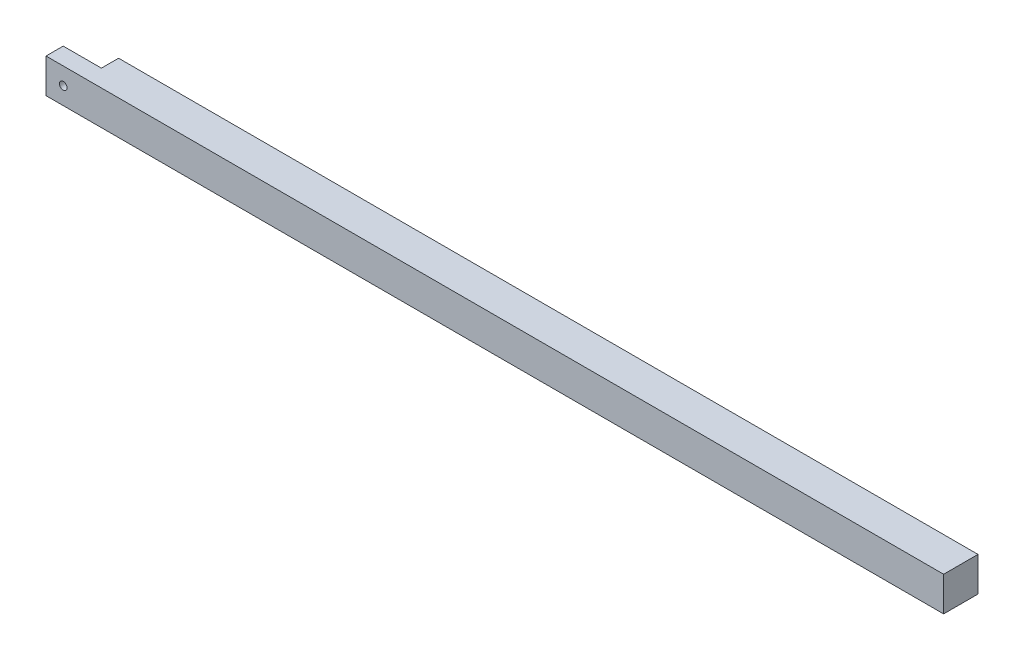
ISO-10303-21;
HEADER;
FILE_DESCRIPTION(('STEP AP214'),'2;1');
FILE_NAME('part.step','',(''),(''),'','','');
FILE_SCHEMA(('AUTOMOTIVE_DESIGN { 1 0 10303 214 1 1 1 1 }'));
ENDSEC;
DATA;
#1=APPLICATION_CONTEXT('core data for automotive mechanical design processes');
#2=APPLICATION_PROTOCOL_DEFINITION('international standard','automotive_design',2000,#1);
#3=PRODUCT_CONTEXT('',#1,'mechanical');
#4=PRODUCT('Part','Part','',(#3));
#5=PRODUCT_RELATED_PRODUCT_CATEGORY('part','',(#4));
#6=PRODUCT_DEFINITION_FORMATION('','',#4);
#7=PRODUCT_DEFINITION_CONTEXT('part definition',#1,'design');
#8=PRODUCT_DEFINITION('design','',#6,#7);
#9=PRODUCT_DEFINITION_SHAPE('','',#8);
#10=(LENGTH_UNIT() NAMED_UNIT(*) SI_UNIT(.MILLI.,.METRE.));
#11=(NAMED_UNIT(*) PLANE_ANGLE_UNIT() SI_UNIT($,.RADIAN.));
#12=(NAMED_UNIT(*) SI_UNIT($,.STERADIAN.) SOLID_ANGLE_UNIT());
#13=UNCERTAINTY_MEASURE_WITH_UNIT(LENGTH_MEASURE(1.E-05),#10,'distance_accuracy_value','');
#14=(GEOMETRIC_REPRESENTATION_CONTEXT(3) GLOBAL_UNCERTAINTY_ASSIGNED_CONTEXT((#13)) GLOBAL_UNIT_ASSIGNED_CONTEXT((#10,
#11,#12)) REPRESENTATION_CONTEXT('',''));
#15=CARTESIAN_POINT('',(0.,0.,0.));
#16=DIRECTION('',(0.,0.,1.));
#17=DIRECTION('',(1.,0.,0.));
#18=AXIS2_PLACEMENT_3D('',#15,#16,#17);
#19=CARTESIAN_POINT('',(0.,0.,9.));
#20=DIRECTION('',(1.,0.,0.));
#21=DIRECTION('',(0.,0.,-1.));
#22=AXIS2_PLACEMENT_3D('',#19,#20,#21);
#23=PLANE('',#22);
#24=DIRECTION('',(0.,1.,0.));
#25=VECTOR('',#24,1.);
#26=CARTESIAN_POINT('',(0.,0.,4.5));
#27=LINE('',#26,#25);
#28=CARTESIAN_POINT('',(0.,0.,4.5));
#29=VERTEX_POINT('',#28);
#30=CARTESIAN_POINT('',(0.,9.,4.5));
#31=VERTEX_POINT('',#30);
#32=EDGE_CURVE('E92',#29,#31,#27,.T.);
#33=ORIENTED_EDGE('',*,*,#32,.F.);
#34=DIRECTION('',(0.,0.,-1.));
#35=VECTOR('',#34,1.);
#36=CARTESIAN_POINT('',(0.,0.,9.));
#37=LINE('',#36,#35);
#38=CARTESIAN_POINT('',(0.,0.,9.));
#39=VERTEX_POINT('',#38);
#40=EDGE_CURVE('E11',#39,#29,#37,.T.);
#41=ORIENTED_EDGE('',*,*,#40,.F.);
#42=DIRECTION('',(0.,-1.,0.));
#43=VECTOR('',#42,1.);
#44=CARTESIAN_POINT('',(0.,0.,9.));
#45=LINE('',#44,#43);
#46=CARTESIAN_POINT('',(0.,9.,9.));
#47=VERTEX_POINT('',#46);
#48=EDGE_CURVE('E111',#47,#39,#45,.T.);
#49=ORIENTED_EDGE('',*,*,#48,.F.);
#50=DIRECTION('',(0.,0.,-1.));
#51=VECTOR('',#50,1.);
#52=CARTESIAN_POINT('',(0.,9.,9.));
#53=LINE('',#52,#51);
#54=EDGE_CURVE('E107',#47,#31,#53,.T.);
#55=ORIENTED_EDGE('',*,*,#54,.T.);
#56=EDGE_LOOP('',(#33,#41,#49,#55));
#57=FACE_BOUND('',#56,.T.);
#58=ADVANCED_FACE('F30',(#57),#23,.F.);
#59=CARTESIAN_POINT('',(0.,0.,9.));
#60=DIRECTION('',(0.,1.,0.));
#61=DIRECTION('',(0.,0.,1.));
#62=AXIS2_PLACEMENT_3D('',#59,#60,#61);
#63=PLANE('',#62);
#64=DIRECTION('',(-1.,0.,0.));
#65=VECTOR('',#64,1.);
#66=CARTESIAN_POINT('',(0.,0.,4.5));
#67=LINE('',#66,#65);
#68=CARTESIAN_POINT('',(10.,0.,4.5));
#69=VERTEX_POINT('',#68);
#70=EDGE_CURVE('E98',#69,#29,#67,.T.);
#71=ORIENTED_EDGE('',*,*,#70,.F.);
#72=DIRECTION('',(0.,0.,-1.));
#73=VECTOR('',#72,1.);
#74=CARTESIAN_POINT('',(10.,0.,4.5));
#75=LINE('',#74,#73);
#76=CARTESIAN_POINT('',(10.,0.,0.));
#77=VERTEX_POINT('',#76);
#78=EDGE_CURVE('E127',#69,#77,#75,.T.);
#79=ORIENTED_EDGE('',*,*,#78,.T.);
#80=DIRECTION('',(1.,0.,0.));
#81=VECTOR('',#80,1.);
#82=CARTESIAN_POINT('',(0.,0.,0.));
#83=LINE('',#82,#81);
#84=CARTESIAN_POINT('',(235.,0.,0.));
#85=VERTEX_POINT('',#84);
#86=EDGE_CURVE('E126',#77,#85,#83,.T.);
#87=ORIENTED_EDGE('',*,*,#86,.T.);
#88=DIRECTION('',(0.,0.,-1.));
#89=VECTOR('',#88,1.);
#90=CARTESIAN_POINT('',(235.,0.,9.));
#91=LINE('',#90,#89);
#92=CARTESIAN_POINT('',(235.,0.,9.));
#93=VERTEX_POINT('',#92);
#94=EDGE_CURVE('E37',#93,#85,#91,.T.);
#95=ORIENTED_EDGE('',*,*,#94,.F.);
#96=DIRECTION('',(1.,0.,0.));
#97=VECTOR('',#96,1.);
#98=CARTESIAN_POINT('',(0.,0.,9.));
#99=LINE('',#98,#97);
#100=EDGE_CURVE('E76',#39,#93,#99,.T.);
#101=ORIENTED_EDGE('',*,*,#100,.F.);
#102=ORIENTED_EDGE('',*,*,#40,.T.);
#103=EDGE_LOOP('',(#71,#79,#87,#95,#101,#102));
#104=FACE_BOUND('',#103,.T.);
#105=ADVANCED_FACE('F156',(#104),#63,.F.);
#106=CARTESIAN_POINT('',(235.,0.,9.));
#107=DIRECTION('',(-1.,0.,0.));
#108=DIRECTION('',(0.,0.,1.));
#109=AXIS2_PLACEMENT_3D('',#106,#107,#108);
#110=PLANE('',#109);
#111=DIRECTION('',(0.,1.,0.));
#112=VECTOR('',#111,1.);
#113=CARTESIAN_POINT('',(235.,0.,0.));
#114=LINE('',#113,#112);
#115=CARTESIAN_POINT('',(235.,9.,0.));
#116=VERTEX_POINT('',#115);
#117=EDGE_CURVE('E69',#85,#116,#114,.T.);
#118=ORIENTED_EDGE('',*,*,#117,.T.);
#119=DIRECTION('',(0.,0.,-1.));
#120=VECTOR('',#119,1.);
#121=CARTESIAN_POINT('',(235.,9.,9.));
#122=LINE('',#121,#120);
#123=CARTESIAN_POINT('',(235.,9.,9.));
#124=VERTEX_POINT('',#123);
#125=EDGE_CURVE('E112',#124,#116,#122,.T.);
#126=ORIENTED_EDGE('',*,*,#125,.F.);
#127=DIRECTION('',(0.,1.,0.));
#128=VECTOR('',#127,1.);
#129=CARTESIAN_POINT('',(235.,0.,9.));
#130=LINE('',#129,#128);
#131=EDGE_CURVE('E115',#93,#124,#130,.T.);
#132=ORIENTED_EDGE('',*,*,#131,.F.);
#133=ORIENTED_EDGE('',*,*,#94,.T.);
#134=EDGE_LOOP('',(#118,#126,#132,#133));
#135=FACE_BOUND('',#134,.T.);
#136=ADVANCED_FACE('F121',(#135),#110,.F.);
#137=CARTESIAN_POINT('',(0.,9.,9.));
#138=DIRECTION('',(0.,-1.,0.));
#139=DIRECTION('',(0.,0.,-1.));
#140=AXIS2_PLACEMENT_3D('',#137,#138,#139);
#141=PLANE('',#140);
#142=DIRECTION('',(-1.,0.,0.));
#143=VECTOR('',#142,1.);
#144=CARTESIAN_POINT('',(0.,9.,0.));
#145=LINE('',#144,#143);
#146=CARTESIAN_POINT('',(10.,9.,0.));
#147=VERTEX_POINT('',#146);
#148=EDGE_CURVE('E118',#116,#147,#145,.T.);
#149=ORIENTED_EDGE('',*,*,#148,.T.);
#150=DIRECTION('',(0.,0.,-1.));
#151=VECTOR('',#150,1.);
#152=CARTESIAN_POINT('',(10.,9.,4.5));
#153=LINE('',#152,#151);
#154=CARTESIAN_POINT('',(10.,9.,4.5));
#155=VERTEX_POINT('',#154);
#156=EDGE_CURVE('E44',#155,#147,#153,.T.);
#157=ORIENTED_EDGE('',*,*,#156,.F.);
#158=DIRECTION('',(1.,0.,0.));
#159=VECTOR('',#158,1.);
#160=CARTESIAN_POINT('',(0.,9.,4.5));
#161=LINE('',#160,#159);
#162=EDGE_CURVE('E96',#31,#155,#161,.T.);
#163=ORIENTED_EDGE('',*,*,#162,.F.);
#164=ORIENTED_EDGE('',*,*,#54,.F.);
#165=DIRECTION('',(-1.,0.,0.));
#166=VECTOR('',#165,1.);
#167=CARTESIAN_POINT('',(0.,9.,9.));
#168=LINE('',#167,#166);
#169=EDGE_CURVE('E53',#124,#47,#168,.T.);
#170=ORIENTED_EDGE('',*,*,#169,.F.);
#171=ORIENTED_EDGE('',*,*,#125,.T.);
#172=EDGE_LOOP('',(#149,#157,#163,#164,#170,#171));
#173=FACE_BOUND('',#172,.T.);
#174=ADVANCED_FACE('F106',(#173),#141,.F.);
#175=CARTESIAN_POINT('',(0.,9.,9.));
#176=DIRECTION('',(0.,0.,-1.));
#177=DIRECTION('',(-1.,0.,0.));
#178=AXIS2_PLACEMENT_3D('',#175,#176,#177);
#179=PLANE('',#178);
#180=CARTESIAN_POINT('',(4.5,4.5,9.));
#181=DIRECTION('',(0.,0.,1.));
#182=DIRECTION('',(1.,0.,0.));
#183=AXIS2_PLACEMENT_3D('',#180,#181,#182);
#184=CIRCLE('',#183,1.);
#185=CARTESIAN_POINT('',(5.5,4.5,9.));
#186=VERTEX_POINT('',#185);
#187=EDGE_CURVE('E140',#186,#186,#184,.T.);
#188=ORIENTED_EDGE('',*,*,#187,.F.);
#189=EDGE_LOOP('',(#188));
#190=FACE_BOUND('',#189,.T.);
#191=ORIENTED_EDGE('',*,*,#48,.T.);
#192=ORIENTED_EDGE('',*,*,#100,.T.);
#193=ORIENTED_EDGE('',*,*,#131,.T.);
#194=ORIENTED_EDGE('',*,*,#169,.T.);
#195=EDGE_LOOP('',(#191,#192,#193,#194));
#196=FACE_BOUND('',#195,.T.);
#197=ADVANCED_FACE('F153',(#190,#196),#179,.F.);
#198=CARTESIAN_POINT('',(0.,9.,0.));
#199=DIRECTION('',(0.,0.,-1.));
#200=DIRECTION('',(-1.,0.,0.));
#201=AXIS2_PLACEMENT_3D('',#198,#199,#200);
#202=PLANE('',#201);
#203=DIRECTION('',(0.,-1.,0.));
#204=VECTOR('',#203,1.);
#205=CARTESIAN_POINT('',(10.,0.,0.));
#206=LINE('',#205,#204);
#207=EDGE_CURVE('E102',#147,#77,#206,.T.);
#208=ORIENTED_EDGE('',*,*,#207,.F.);
#209=ORIENTED_EDGE('',*,*,#148,.F.);
#210=ORIENTED_EDGE('',*,*,#117,.F.);
#211=ORIENTED_EDGE('',*,*,#86,.F.);
#212=EDGE_LOOP('',(#208,#209,#210,#211));
#213=FACE_BOUND('',#212,.T.);
#214=ADVANCED_FACE('F125',(#213),#202,.T.);
#215=CARTESIAN_POINT('',(10.,0.,4.5));
#216=DIRECTION('',(1.,0.,0.));
#217=DIRECTION('',(0.,0.,-1.));
#218=AXIS2_PLACEMENT_3D('',#215,#216,#217);
#219=PLANE('',#218);
#220=ORIENTED_EDGE('',*,*,#207,.T.);
#221=ORIENTED_EDGE('',*,*,#78,.F.);
#222=DIRECTION('',(0.,-1.,0.));
#223=VECTOR('',#222,1.);
#224=CARTESIAN_POINT('',(10.,0.,4.5));
#225=LINE('',#224,#223);
#226=EDGE_CURVE('E109',#155,#69,#225,.T.);
#227=ORIENTED_EDGE('',*,*,#226,.F.);
#228=ORIENTED_EDGE('',*,*,#156,.T.);
#229=EDGE_LOOP('',(#220,#221,#227,#228));
#230=FACE_BOUND('',#229,.T.);
#231=ADVANCED_FACE('F157',(#230),#219,.F.);
#232=CARTESIAN_POINT('',(0.,9.,4.5));
#233=DIRECTION('',(0.,0.,-1.));
#234=DIRECTION('',(-1.,0.,0.));
#235=AXIS2_PLACEMENT_3D('',#232,#233,#234);
#236=PLANE('',#235);
#237=CARTESIAN_POINT('',(4.5,4.5,4.5));
#238=DIRECTION('',(0.,0.,1.));
#239=DIRECTION('',(1.,0.,0.));
#240=AXIS2_PLACEMENT_3D('',#237,#238,#239);
#241=CIRCLE('',#240,1.);
#242=CARTESIAN_POINT('',(5.5,4.5,4.5));
#243=VERTEX_POINT('',#242);
#244=EDGE_CURVE('E137',#243,#243,#241,.T.);
#245=ORIENTED_EDGE('',*,*,#244,.T.);
#246=EDGE_LOOP('',(#245));
#247=FACE_BOUND('',#246,.T.);
#248=ORIENTED_EDGE('',*,*,#32,.T.);
#249=ORIENTED_EDGE('',*,*,#162,.T.);
#250=ORIENTED_EDGE('',*,*,#226,.T.);
#251=ORIENTED_EDGE('',*,*,#70,.T.);
#252=EDGE_LOOP('',(#248,#249,#250,#251));
#253=FACE_BOUND('',#252,.T.);
#254=ADVANCED_FACE('F94',(#247,#253),#236,.T.);
#255=CARTESIAN_POINT('',(4.5,4.5,4.5));
#256=DIRECTION('',(0.,0.,1.));
#257=DIRECTION('',(1.,0.,0.));
#258=AXIS2_PLACEMENT_3D('',#255,#256,#257);
#259=CYLINDRICAL_SURFACE('',#258,1.);
#260=ORIENTED_EDGE('',*,*,#244,.F.);
#261=EDGE_LOOP('',(#260));
#262=FACE_BOUND('',#261,.T.);
#263=ORIENTED_EDGE('',*,*,#187,.T.);
#264=EDGE_LOOP('',(#263));
#265=FACE_BOUND('',#264,.T.);
#266=ADVANCED_FACE('F147',(#262,#265),#259,.F.);
#267=CLOSED_SHELL('',(#58,#105,#136,#174,#197,#214,#231,#254,#266));
#268=MANIFOLD_SOLID_BREP('B2',#267);
#269=ADVANCED_BREP_SHAPE_REPRESENTATION('',(#18,#268),#14);
#270=SHAPE_DEFINITION_REPRESENTATION(#9,#269);
ENDSEC;
END-ISO-10303-21;
